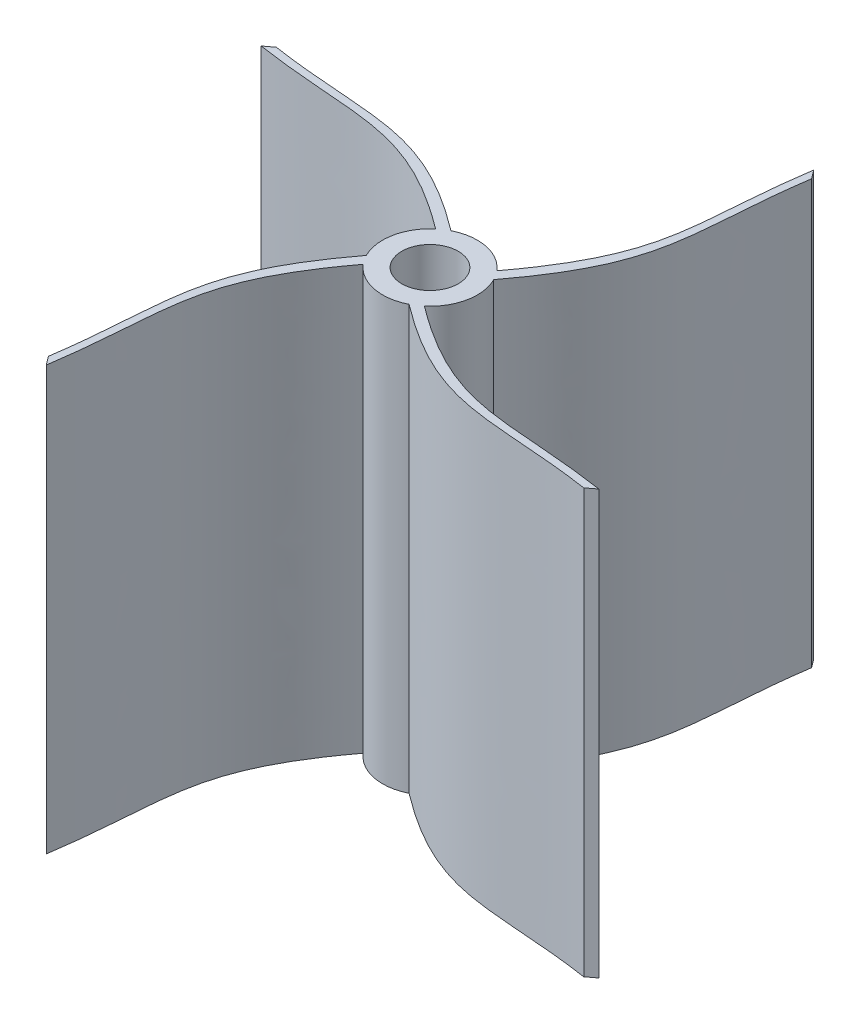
from build123d import *

# Parameters (mm, degrees)
BOSS_EXTRUDE1_DEPTH = 300
SKETCH3_R           = 20
CUT_EXTRUDE1_DEPTH  = 250


with BuildPart() as part:
    # Sketch1 → Boss-Extrude1 (new body)
    with BuildSketch(Plane(origin=(0, 0, 0), x_dir=(1, 0, 0), z_dir=(0, 1, 0))):
        with BuildLine():
            Line((-167.94142776, 55.049899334), (-174.026951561, 50.429814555))
            add(Edge.make_bspline(
                [(0, 0), (-71.160452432, 53.387433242), (-97.235147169, 38.785604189), (-174.026951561, 50.429814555)],
                knots=[0, 0, 0, 0, 1, 1, 1, 1], degree=3))
            ThreePointArc((0, 0), (-11.230713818, -18.964481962), (-8.296768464, -40.808759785))
            add(Edge.make_bspline(
                [(-8.296768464, -40.808759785), (-62.135864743, -112.049101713), (-47.53403569, -138.12379645), (-59.006901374, -215.304892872)],
                knots=[0, 0, 0, 0, 1, 1, 1, 1], degree=3))
            Line((-59.006901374, -215.304892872), (-54.386816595, -221.390416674))
            add(Edge.make_bspline(
                [(-3.95700204, -47.363465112), (-57.344435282, -118.523917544), (-42.742606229, -144.598612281), (-54.386816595, -221.390416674)],
                knots=[0, 0, 0, 0, 1, 1, 1, 1], degree=3))
            ThreePointArc((-3.95700204, -47.363465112), (15.007479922, -58.594178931), (36.851757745, -55.660233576))
            add(Edge.make_bspline(
                [(36.851757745, -55.660233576), (108.092099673, -109.499329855), (134.16679441, -94.897500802), (211.347890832, -106.370366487)],
                knots=[0, 0, 0, 0, 1, 1, 1, 1], degree=3))
            Line((211.347890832, -106.370366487), (217.433414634, -101.750281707))
            add(Edge.make_bspline(
                [(43.406463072, -51.320467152), (114.566915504, -104.707900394), (140.641610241, -90.106071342), (217.433414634, -101.750281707)],
                knots=[0, 0, 0, 0, 1, 1, 1, 1], degree=3))
            ThreePointArc((43.406463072, -51.320467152), (54.637176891, -32.35598519), (51.703231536, -10.511707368))
            add(Edge.make_bspline(
                [(51.703231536, -10.511707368), (105.542327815, 60.728634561), (90.940498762, 86.803329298), (102.413364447, 163.98442572)],
                knots=[0, 0, 0, 0, 1, 1, 1, 1], degree=3))
            Line((102.413364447, 163.98442572), (97.793279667, 170.069949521))
            add(Edge.make_bspline(
                [(47.363465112, -3.95700204), (100.750898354, 67.203450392), (86.149069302, 93.278145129), (97.793279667, 170.069949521)],
                knots=[0, 0, 0, 0, 1, 1, 1, 1], degree=3))
            ThreePointArc((47.363465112, -3.95700204), (28.39898315, 7.273711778), (6.554705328, 4.339766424))
            add(Edge.make_bspline(
                [(6.554705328, 4.339766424), (-64.685636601, 58.178862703), (-90.760331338, 43.57703365), (-167.94142776, 55.049899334)],
                knots=[0, 0, 0, 0, 1, 1, 1, 1], degree=3))
        make_face()
    extrude(amount=BOSS_EXTRUDE1_DEPTH)

    # Sketch3 → Cut-Extrude1 (cut)
    with BuildSketch(Plane(origin=(0, 300, 0), x_dir=(1, 0, 0), z_dir=(0, 1, 0))):
        with Locations(Location((21.703231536, -25.660233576, 0), (0, 0, 270))):
            Circle(SKETCH3_R)
    extrude(amount=-CUT_EXTRUDE1_DEPTH, mode=Mode.SUBTRACT)


solid = part.part
